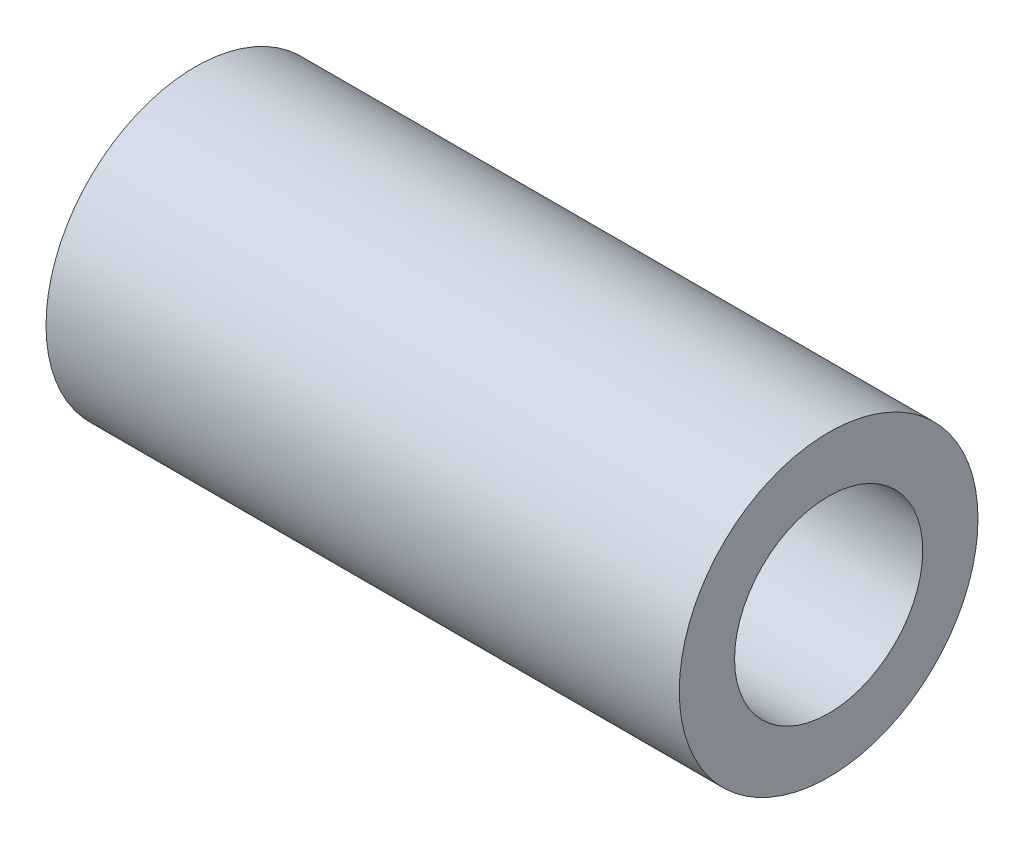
from build123d import *

# Parameters (mm, degrees)
SKETCH1_R    = 9.525
SKETCH1_R_2  = 6
SPACER_DEPTH = 40.386


with BuildPart() as part:
    # Sketch1 → Spacer (new body)
    with BuildSketch(Plane(origin=(0, 0, 0), x_dir=(0, 0, -1), z_dir=(1, 0, 0))):
        Circle(SKETCH1_R)
        Circle(SKETCH1_R_2, mode=Mode.SUBTRACT)
    extrude(amount=SPACER_DEPTH)


solid = part.part
